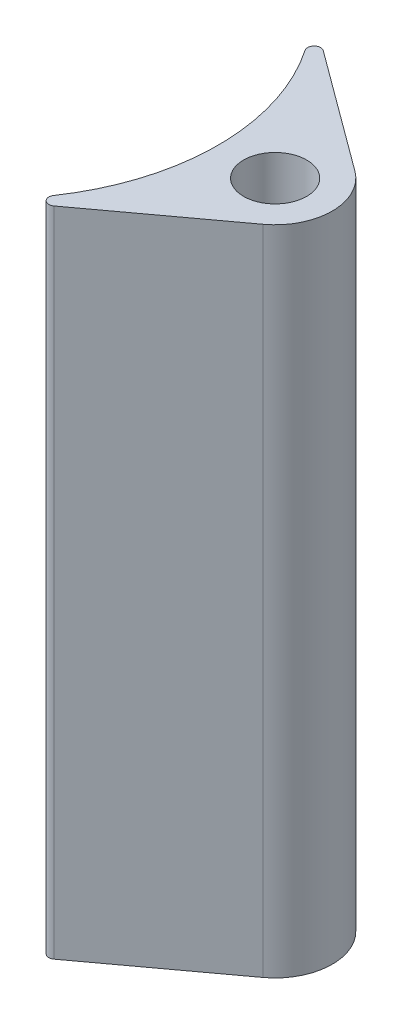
ISO-10303-21;
HEADER;
FILE_DESCRIPTION(('STEP AP214'),'2;1');
FILE_NAME('part.step','',(''),(''),'','','');
FILE_SCHEMA(('AUTOMOTIVE_DESIGN { 1 0 10303 214 1 1 1 1 }'));
ENDSEC;
DATA;
#1=APPLICATION_CONTEXT('core data for automotive mechanical design processes');
#2=APPLICATION_PROTOCOL_DEFINITION('international standard','automotive_design',2000,#1);
#3=PRODUCT_CONTEXT('',#1,'mechanical');
#4=PRODUCT('Part','Part','',(#3));
#5=PRODUCT_RELATED_PRODUCT_CATEGORY('part','',(#4));
#6=PRODUCT_DEFINITION_FORMATION('','',#4);
#7=PRODUCT_DEFINITION_CONTEXT('part definition',#1,'design');
#8=PRODUCT_DEFINITION('design','',#6,#7);
#9=PRODUCT_DEFINITION_SHAPE('','',#8);
#10=(LENGTH_UNIT() NAMED_UNIT(*) SI_UNIT(.MILLI.,.METRE.));
#11=(NAMED_UNIT(*) PLANE_ANGLE_UNIT() SI_UNIT($,.RADIAN.));
#12=(NAMED_UNIT(*) SI_UNIT($,.STERADIAN.) SOLID_ANGLE_UNIT());
#13=UNCERTAINTY_MEASURE_WITH_UNIT(LENGTH_MEASURE(1.E-05),#10,'distance_accuracy_value','');
#14=(GEOMETRIC_REPRESENTATION_CONTEXT(3) GLOBAL_UNCERTAINTY_ASSIGNED_CONTEXT((#13)) GLOBAL_UNIT_ASSIGNED_CONTEXT((#10,
#11,#12)) REPRESENTATION_CONTEXT('',''));
#15=CARTESIAN_POINT('',(0.,0.,0.));
#16=DIRECTION('',(0.,0.,1.));
#17=DIRECTION('',(1.,0.,0.));
#18=AXIS2_PLACEMENT_3D('',#15,#16,#17);
#19=CARTESIAN_POINT('',(14.8043777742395,50.8,10.0742765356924));
#20=DIRECTION('',(0.,-1.,0.));
#21=DIRECTION('',(0.,0.,-1.));
#22=AXIS2_PLACEMENT_3D('',#19,#20,#21);
#23=CYLINDRICAL_SURFACE('',#22,0.508);
#24=CARTESIAN_POINT('',(14.8043777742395,0.,10.0742765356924));
#25=DIRECTION('',(0.,1.,0.));
#26=DIRECTION('',(0.,0.,-1.));
#27=AXIS2_PLACEMENT_3D('',#24,#25,#26);
#28=CIRCLE('',#27,0.508);
#29=CARTESIAN_POINT('',(14.3843954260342,0.,9.78848145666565));
#30=VERTEX_POINT('',#29);
#31=CARTESIAN_POINT('',(15.105633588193,0.,10.4833106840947));
#32=VERTEX_POINT('',#31);
#33=EDGE_CURVE('E118',#30,#32,#28,.T.);
#34=ORIENTED_EDGE('',*,*,#33,.T.);
#35=DIRECTION('',(0.,-1.,0.));
#36=VECTOR('',#35,1.);
#37=CARTESIAN_POINT('',(15.105633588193,50.8,10.4833106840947));
#38=LINE('',#37,#36);
#39=CARTESIAN_POINT('',(15.105633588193,50.8,10.4833106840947));
#40=VERTEX_POINT('',#39);
#41=EDGE_CURVE('E11',#40,#32,#38,.T.);
#42=ORIENTED_EDGE('',*,*,#41,.F.);
#43=CARTESIAN_POINT('',(14.8043777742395,50.8,10.0742765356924));
#44=DIRECTION('',(0.,1.,0.));
#45=DIRECTION('',(0.,0.,-1.));
#46=AXIS2_PLACEMENT_3D('',#43,#44,#45);
#47=CIRCLE('',#46,0.508);
#48=CARTESIAN_POINT('',(14.3843954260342,50.8,9.78848145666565));
#49=VERTEX_POINT('',#48);
#50=EDGE_CURVE('E129',#49,#40,#47,.T.);
#51=ORIENTED_EDGE('',*,*,#50,.F.);
#52=DIRECTION('',(0.,-1.,0.));
#53=VECTOR('',#52,1.);
#54=CARTESIAN_POINT('',(14.3843954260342,50.8,9.78848145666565));
#55=LINE('',#54,#53);
#56=EDGE_CURVE('E114',#49,#30,#55,.T.);
#57=ORIENTED_EDGE('',*,*,#56,.T.);
#58=EDGE_LOOP('',(#34,#42,#51,#57));
#59=FACE_BOUND('',#58,.T.);
#60=ADVANCED_FACE('F34',(#59),#23,.T.);
#61=CARTESIAN_POINT('',(15.105633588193,50.8,10.4833106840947));
#62=DIRECTION('',(-0.593023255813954,0.,-0.805185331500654));
#63=DIRECTION('',(-0.805185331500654,0.,0.593023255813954));
#64=AXIS2_PLACEMENT_3D('',#61,#62,#63);
#65=PLANE('',#64);
#66=DIRECTION('',(0.805185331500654,0.,-0.593023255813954));
#67=VECTOR('',#66,1.);
#68=CARTESIAN_POINT('',(15.105633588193,0.,10.4833106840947));
#69=LINE('',#68,#67);
#70=CARTESIAN_POINT('',(24.479988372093,0.,3.5790487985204));
#71=VERTEX_POINT('',#70);
#72=EDGE_CURVE('E121',#32,#71,#69,.T.);
#73=ORIENTED_EDGE('',*,*,#72,.T.);
#74=DIRECTION('',(0.,-1.,0.));
#75=VECTOR('',#74,1.);
#76=CARTESIAN_POINT('',(24.479988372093,50.8,3.5790487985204));
#77=LINE('',#76,#75);
#78=CARTESIAN_POINT('',(24.479988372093,50.8,3.5790487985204));
#79=VERTEX_POINT('',#78);
#80=EDGE_CURVE('E42',#79,#71,#77,.T.);
#81=ORIENTED_EDGE('',*,*,#80,.F.);
#82=DIRECTION('',(0.805185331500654,0.,-0.593023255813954));
#83=VECTOR('',#82,1.);
#84=CARTESIAN_POINT('',(15.105633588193,50.8,10.4833106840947));
#85=LINE('',#84,#83);
#86=EDGE_CURVE('E87',#40,#79,#85,.T.);
#87=ORIENTED_EDGE('',*,*,#86,.F.);
#88=ORIENTED_EDGE('',*,*,#41,.T.);
#89=EDGE_LOOP('',(#73,#81,#87,#88));
#90=FACE_BOUND('',#89,.T.);
#91=ADVANCED_FACE('F154',(#90),#65,.F.);
#92=CARTESIAN_POINT('',(21.844,50.8,0.));
#93=DIRECTION('',(0.,-1.,0.));
#94=DIRECTION('',(0.,0.,-1.));
#95=AXIS2_PLACEMENT_3D('',#92,#93,#94);
#96=CYLINDRICAL_SURFACE('',#95,4.44499999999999);
#97=CARTESIAN_POINT('',(21.844,0.,0.));
#98=DIRECTION('',(0.,1.,0.));
#99=DIRECTION('',(0.,0.,1.));
#100=AXIS2_PLACEMENT_3D('',#97,#98,#99);
#101=CIRCLE('',#100,4.44499999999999);
#102=CARTESIAN_POINT('',(24.479988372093,0.,-3.5790487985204));
#103=VERTEX_POINT('',#102);
#104=EDGE_CURVE('E124',#71,#103,#101,.T.);
#105=ORIENTED_EDGE('',*,*,#104,.T.);
#106=DIRECTION('',(0.,-1.,0.));
#107=VECTOR('',#106,1.);
#108=CARTESIAN_POINT('',(24.479988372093,50.8,-3.5790487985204));
#109=LINE('',#108,#107);
#110=CARTESIAN_POINT('',(24.479988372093,50.8,-3.5790487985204));
#111=VERTEX_POINT('',#110);
#112=EDGE_CURVE('E109',#111,#103,#109,.T.);
#113=ORIENTED_EDGE('',*,*,#112,.F.);
#114=CARTESIAN_POINT('',(21.844,50.8,0.));
#115=DIRECTION('',(0.,1.,0.));
#116=DIRECTION('',(0.,0.,1.));
#117=AXIS2_PLACEMENT_3D('',#114,#115,#116);
#118=CIRCLE('',#117,4.44499999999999);
#119=EDGE_CURVE('E100',#79,#111,#118,.T.);
#120=ORIENTED_EDGE('',*,*,#119,.F.);
#121=ORIENTED_EDGE('',*,*,#80,.T.);
#122=EDGE_LOOP('',(#105,#113,#120,#121));
#123=FACE_BOUND('',#122,.T.);
#124=ADVANCED_FACE('F135',(#123),#96,.T.);
#125=CARTESIAN_POINT('',(15.105633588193,50.8,-10.4833106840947));
#126=DIRECTION('',(-0.593023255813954,0.,0.805185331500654));
#127=DIRECTION('',(0.805185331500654,0.,0.593023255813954));
#128=AXIS2_PLACEMENT_3D('',#125,#126,#127);
#129=PLANE('',#128);
#130=DIRECTION('',(-0.805185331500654,0.,-0.593023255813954));
#131=VECTOR('',#130,1.);
#132=CARTESIAN_POINT('',(15.105633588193,0.,-10.4833106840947));
#133=LINE('',#132,#131);
#134=CARTESIAN_POINT('',(15.105633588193,0.,-10.4833106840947));
#135=VERTEX_POINT('',#134);
#136=EDGE_CURVE('E108',#103,#135,#133,.T.);
#137=ORIENTED_EDGE('',*,*,#136,.T.);
#138=DIRECTION('',(0.,-1.,0.));
#139=VECTOR('',#138,1.);
#140=CARTESIAN_POINT('',(15.105633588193,50.8,-10.4833106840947));
#141=LINE('',#140,#139);
#142=CARTESIAN_POINT('',(15.105633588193,50.8,-10.4833106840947));
#143=VERTEX_POINT('',#142);
#144=EDGE_CURVE('E105',#143,#135,#141,.T.);
#145=ORIENTED_EDGE('',*,*,#144,.F.);
#146=DIRECTION('',(-0.805185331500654,0.,-0.593023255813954));
#147=VECTOR('',#146,1.);
#148=CARTESIAN_POINT('',(15.105633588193,50.8,-10.4833106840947));
#149=LINE('',#148,#147);
#150=EDGE_CURVE('E94',#111,#143,#149,.T.);
#151=ORIENTED_EDGE('',*,*,#150,.F.);
#152=ORIENTED_EDGE('',*,*,#112,.T.);
#153=EDGE_LOOP('',(#137,#145,#151,#152));
#154=FACE_BOUND('',#153,.T.);
#155=ADVANCED_FACE('F106',(#154),#129,.F.);
#156=CARTESIAN_POINT('',(14.8043777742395,50.8,-10.0742765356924));
#157=DIRECTION('',(0.,-1.,0.));
#158=DIRECTION('',(0.,0.,-1.));
#159=AXIS2_PLACEMENT_3D('',#156,#157,#158);
#160=CYLINDRICAL_SURFACE('',#159,0.508);
#161=CARTESIAN_POINT('',(14.8043777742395,0.,-10.0742765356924));
#162=DIRECTION('',(0.,1.,0.));
#163=DIRECTION('',(0.,0.,1.));
#164=AXIS2_PLACEMENT_3D('',#161,#162,#163);
#165=CIRCLE('',#164,0.508);
#166=CARTESIAN_POINT('',(14.3843954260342,0.,-9.78848145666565));
#167=VERTEX_POINT('',#166);
#168=EDGE_CURVE('E73',#135,#167,#165,.T.);
#169=ORIENTED_EDGE('',*,*,#168,.T.);
#170=DIRECTION('',(0.,-1.,0.));
#171=VECTOR('',#170,1.);
#172=CARTESIAN_POINT('',(14.3843954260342,50.8,-9.78848145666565));
#173=LINE('',#172,#171);
#174=CARTESIAN_POINT('',(14.3843954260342,50.8,-9.78848145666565));
#175=VERTEX_POINT('',#174);
#176=EDGE_CURVE('E110',#175,#167,#173,.T.);
#177=ORIENTED_EDGE('',*,*,#176,.F.);
#178=CARTESIAN_POINT('',(14.8043777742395,50.8,-10.0742765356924));
#179=DIRECTION('',(0.,1.,0.));
#180=DIRECTION('',(0.,0.,1.));
#181=AXIS2_PLACEMENT_3D('',#178,#179,#180);
#182=CIRCLE('',#181,0.508);
#183=EDGE_CURVE('E98',#143,#175,#182,.T.);
#184=ORIENTED_EDGE('',*,*,#183,.F.);
#185=ORIENTED_EDGE('',*,*,#144,.T.);
#186=EDGE_LOOP('',(#169,#177,#184,#185));
#187=FACE_BOUND('',#186,.T.);
#188=ADVANCED_FACE('F112',(#187),#160,.T.);
#189=CARTESIAN_POINT('',(0.,50.8,0.));
#190=DIRECTION('',(0.,-1.,0.));
#191=DIRECTION('',(0.,0.,-1.));
#192=AXIS2_PLACEMENT_3D('',#189,#190,#191);
#193=CYLINDRICAL_SURFACE('',#192,17.399);
#194=CARTESIAN_POINT('',(0.,0.,0.));
#195=DIRECTION('',(0.,-1.,0.));
#196=DIRECTION('',(0.,0.,1.));
#197=AXIS2_PLACEMENT_3D('',#194,#195,#196);
#198=CIRCLE('',#197,17.399);
#199=EDGE_CURVE('E79',#167,#30,#198,.T.);
#200=ORIENTED_EDGE('',*,*,#199,.T.);
#201=ORIENTED_EDGE('',*,*,#56,.F.);
#202=CARTESIAN_POINT('',(0.,50.8,0.));
#203=DIRECTION('',(0.,-1.,0.));
#204=DIRECTION('',(0.,0.,1.));
#205=AXIS2_PLACEMENT_3D('',#202,#203,#204);
#206=CIRCLE('',#205,17.399);
#207=EDGE_CURVE('E50',#175,#49,#206,.T.);
#208=ORIENTED_EDGE('',*,*,#207,.F.);
#209=ORIENTED_EDGE('',*,*,#176,.T.);
#210=EDGE_LOOP('',(#200,#201,#208,#209));
#211=FACE_BOUND('',#210,.T.);
#212=ADVANCED_FACE('F142',(#211),#193,.F.);
#213=CARTESIAN_POINT('',(14.8043777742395,50.8,10.0742765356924));
#214=DIRECTION('',(0.,-1.,0.));
#215=DIRECTION('',(0.,0.,-1.));
#216=AXIS2_PLACEMENT_3D('',#213,#214,#215);
#217=PLANE('',#216);
#218=CARTESIAN_POINT('',(21.844,50.8,0.));
#219=DIRECTION('',(0.,1.,0.));
#220=DIRECTION('',(0.,0.,1.));
#221=AXIS2_PLACEMENT_3D('',#218,#219,#220);
#222=CIRCLE('',#221,2.45744999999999);
#223=CARTESIAN_POINT('',(21.844,50.8,2.45744999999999));
#224=VERTEX_POINT('',#223);
#225=EDGE_CURVE('E209',#224,#224,#222,.T.);
#226=ORIENTED_EDGE('',*,*,#225,.F.);
#227=EDGE_LOOP('',(#226));
#228=FACE_BOUND('',#227,.T.);
#229=ORIENTED_EDGE('',*,*,#50,.T.);
#230=ORIENTED_EDGE('',*,*,#86,.T.);
#231=ORIENTED_EDGE('',*,*,#119,.T.);
#232=ORIENTED_EDGE('',*,*,#150,.T.);
#233=ORIENTED_EDGE('',*,*,#183,.T.);
#234=ORIENTED_EDGE('',*,*,#207,.T.);
#235=EDGE_LOOP('',(#229,#230,#231,#232,#233,#234));
#236=FACE_BOUND('',#235,.T.);
#237=ADVANCED_FACE('F96',(#228,#236),#217,.F.);
#238=CARTESIAN_POINT('',(14.8043777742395,0.,10.0742765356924));
#239=DIRECTION('',(0.,-1.,0.));
#240=DIRECTION('',(0.,0.,-1.));
#241=AXIS2_PLACEMENT_3D('',#238,#239,#240);
#242=PLANE('',#241);
#243=CARTESIAN_POINT('',(21.844,0.,0.));
#244=DIRECTION('',(0.,1.,0.));
#245=DIRECTION('',(0.,0.,1.));
#246=AXIS2_PLACEMENT_3D('',#243,#244,#245);
#247=CIRCLE('',#246,2.45744999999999);
#248=CARTESIAN_POINT('',(21.844,0.,2.45744999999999));
#249=VERTEX_POINT('',#248);
#250=EDGE_CURVE('E122',#249,#249,#247,.T.);
#251=ORIENTED_EDGE('',*,*,#250,.T.);
#252=EDGE_LOOP('',(#251));
#253=FACE_BOUND('',#252,.T.);
#254=ORIENTED_EDGE('',*,*,#33,.F.);
#255=ORIENTED_EDGE('',*,*,#199,.F.);
#256=ORIENTED_EDGE('',*,*,#168,.F.);
#257=ORIENTED_EDGE('',*,*,#136,.F.);
#258=ORIENTED_EDGE('',*,*,#104,.F.);
#259=ORIENTED_EDGE('',*,*,#72,.F.);
#260=EDGE_LOOP('',(#254,#255,#256,#257,#258,#259));
#261=FACE_BOUND('',#260,.T.);
#262=ADVANCED_FACE('F138',(#253,#261),#242,.T.);
#263=CARTESIAN_POINT('',(21.844,50.8,0.));
#264=DIRECTION('',(0.,1.,0.));
#265=DIRECTION('',(0.,0.,1.));
#266=AXIS2_PLACEMENT_3D('',#263,#264,#265);
#267=CYLINDRICAL_SURFACE('',#266,2.45744999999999);
#268=ORIENTED_EDGE('',*,*,#250,.F.);
#269=EDGE_LOOP('',(#268));
#270=FACE_BOUND('',#269,.T.);
#271=ORIENTED_EDGE('',*,*,#225,.T.);
#272=EDGE_LOOP('',(#271));
#273=FACE_BOUND('',#272,.T.);
#274=ADVANCED_FACE('F191',(#270,#273),#267,.F.);
#275=CLOSED_SHELL('',(#60,#91,#124,#155,#188,#212,#237,#262,#274));
#276=MANIFOLD_SOLID_BREP('B2',#275);
#277=ADVANCED_BREP_SHAPE_REPRESENTATION('',(#18,#276),#14);
#278=SHAPE_DEFINITION_REPRESENTATION(#9,#277);
ENDSEC;
END-ISO-10303-21;
